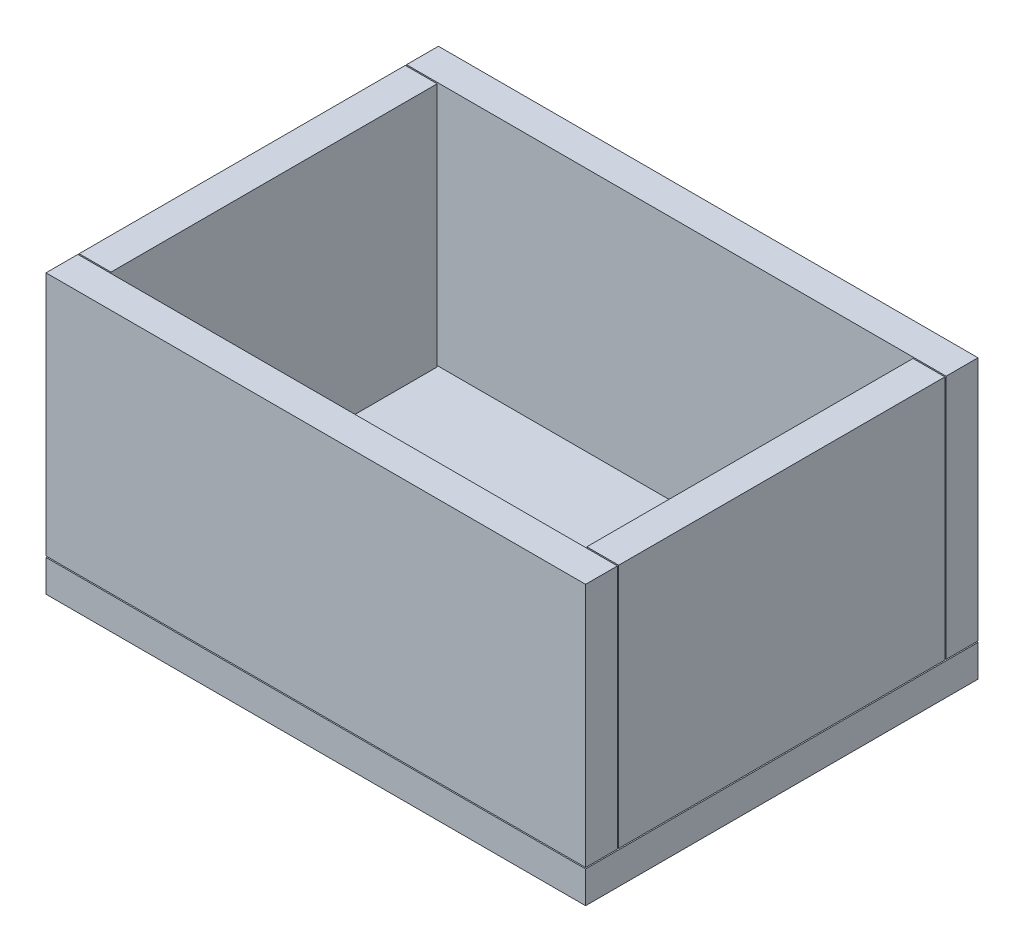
ISO-10303-21;
HEADER;
FILE_DESCRIPTION(('STEP AP214'),'2;1');
FILE_NAME('part.step','',(''),(''),'','','');
FILE_SCHEMA(('AUTOMOTIVE_DESIGN { 1 0 10303 214 1 1 1 1 }'));
ENDSEC;
DATA;
#1=APPLICATION_CONTEXT('core data for automotive mechanical design processes');
#2=APPLICATION_PROTOCOL_DEFINITION('international standard','automotive_design',2000,#1);
#3=PRODUCT_CONTEXT('',#1,'mechanical');
#4=PRODUCT('Part','Part','',(#3));
#5=PRODUCT_RELATED_PRODUCT_CATEGORY('part','',(#4));
#6=PRODUCT_DEFINITION_FORMATION('','',#4);
#7=PRODUCT_DEFINITION_CONTEXT('part definition',#1,'design');
#8=PRODUCT_DEFINITION('design','',#6,#7);
#9=PRODUCT_DEFINITION_SHAPE('','',#8);
#10=(LENGTH_UNIT() NAMED_UNIT(*) SI_UNIT(.MILLI.,.METRE.));
#11=(NAMED_UNIT(*) PLANE_ANGLE_UNIT() SI_UNIT($,.RADIAN.));
#12=(NAMED_UNIT(*) SI_UNIT($,.STERADIAN.) SOLID_ANGLE_UNIT());
#13=UNCERTAINTY_MEASURE_WITH_UNIT(LENGTH_MEASURE(1.E-05),#10,'distance_accuracy_value','');
#14=(GEOMETRIC_REPRESENTATION_CONTEXT(3) GLOBAL_UNCERTAINTY_ASSIGNED_CONTEXT((#13)) GLOBAL_UNIT_ASSIGNED_CONTEXT((#10,
#11,#12)) REPRESENTATION_CONTEXT('',''));
#15=CARTESIAN_POINT('',(0.,0.,0.));
#16=DIRECTION('',(0.,0.,1.));
#17=DIRECTION('',(1.,0.,0.));
#18=AXIS2_PLACEMENT_3D('',#15,#16,#17);
#19=CARTESIAN_POINT('',(110.,247.13382805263,-66.5));
#20=DIRECTION('',(-1.,0.,0.));
#21=DIRECTION('',(0.,0.,1.));
#22=AXIS2_PLACEMENT_3D('',#19,#20,#21);
#23=PLANE('',#22);
#24=DIRECTION('',(0.,0.,-1.));
#25=VECTOR('',#24,1.);
#26=CARTESIAN_POINT('',(110.,113.5,-66.5));
#27=LINE('',#26,#25);
#28=CARTESIAN_POINT('',(110.,113.5,66.5));
#29=VERTEX_POINT('',#28);
#30=CARTESIAN_POINT('',(110.,113.5,-66.5));
#31=VERTEX_POINT('',#30);
#32=EDGE_CURVE('E94',#29,#31,#27,.T.);
#33=ORIENTED_EDGE('',*,*,#32,.F.);
#34=DIRECTION('',(0.,-1.,0.));
#35=VECTOR('',#34,1.);
#36=CARTESIAN_POINT('',(110.,247.13382805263,66.5));
#37=LINE('',#36,#35);
#38=CARTESIAN_POINT('',(110.,13.5,66.5));
#39=VERTEX_POINT('',#38);
#40=EDGE_CURVE('E48',#29,#39,#37,.T.);
#41=ORIENTED_EDGE('',*,*,#40,.T.);
#42=DIRECTION('',(0.,0.,-1.));
#43=VECTOR('',#42,1.);
#44=CARTESIAN_POINT('',(110.,13.5,-66.5));
#45=LINE('',#44,#43);
#46=CARTESIAN_POINT('',(110.,13.5,-66.5));
#47=VERTEX_POINT('',#46);
#48=EDGE_CURVE('E92',#39,#47,#45,.T.);
#49=ORIENTED_EDGE('',*,*,#48,.T.);
#50=DIRECTION('',(0.,-1.,0.));
#51=VECTOR('',#50,1.);
#52=CARTESIAN_POINT('',(110.,247.13382805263,-66.5));
#53=LINE('',#52,#51);
#54=EDGE_CURVE('E83',#31,#47,#53,.T.);
#55=ORIENTED_EDGE('',*,*,#54,.F.);
#56=EDGE_LOOP('',(#33,#41,#49,#55));
#57=FACE_BOUND('',#56,.T.);
#58=ADVANCED_FACE('F44',(#57),#23,.F.);
#59=CARTESIAN_POINT('',(110.,247.13382805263,-66.5));
#60=DIRECTION('',(0.,0.,1.));
#61=DIRECTION('',(1.,0.,0.));
#62=AXIS2_PLACEMENT_3D('',#59,#60,#61);
#63=PLANE('',#62);
#64=DIRECTION('',(-1.,0.,0.));
#65=VECTOR('',#64,1.);
#66=CARTESIAN_POINT('',(110.,113.5,-66.5));
#67=LINE('',#66,#65);
#68=CARTESIAN_POINT('',(97.,113.5,-66.5));
#69=VERTEX_POINT('',#68);
#70=EDGE_CURVE('E53',#31,#69,#67,.T.);
#71=ORIENTED_EDGE('',*,*,#70,.F.);
#72=ORIENTED_EDGE('',*,*,#54,.T.);
#73=DIRECTION('',(-1.,0.,0.));
#74=VECTOR('',#73,1.);
#75=CARTESIAN_POINT('',(110.,13.5,-66.5));
#76=LINE('',#75,#74);
#77=CARTESIAN_POINT('',(97.,13.5,-66.5));
#78=VERTEX_POINT('',#77);
#79=EDGE_CURVE('E104',#47,#78,#76,.T.);
#80=ORIENTED_EDGE('',*,*,#79,.T.);
#81=DIRECTION('',(0.,-1.,0.));
#82=VECTOR('',#81,1.);
#83=CARTESIAN_POINT('',(97.,247.13382805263,-66.5));
#84=LINE('',#83,#82);
#85=EDGE_CURVE('E113',#69,#78,#84,.T.);
#86=ORIENTED_EDGE('',*,*,#85,.F.);
#87=EDGE_LOOP('',(#71,#72,#80,#86));
#88=FACE_BOUND('',#87,.T.);
#89=ADVANCED_FACE('F117',(#88),#63,.F.);
#90=CARTESIAN_POINT('',(97.,247.13382805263,-66.5));
#91=DIRECTION('',(1.,0.,0.));
#92=DIRECTION('',(0.,0.,-1.));
#93=AXIS2_PLACEMENT_3D('',#90,#91,#92);
#94=PLANE('',#93);
#95=DIRECTION('',(0.,0.,1.));
#96=VECTOR('',#95,1.);
#97=CARTESIAN_POINT('',(97.,113.5,-66.5));
#98=LINE('',#97,#96);
#99=CARTESIAN_POINT('',(97.,113.5,66.5));
#100=VERTEX_POINT('',#99);
#101=EDGE_CURVE('E12',#69,#100,#98,.T.);
#102=ORIENTED_EDGE('',*,*,#101,.F.);
#103=ORIENTED_EDGE('',*,*,#85,.T.);
#104=DIRECTION('',(0.,0.,1.));
#105=VECTOR('',#104,1.);
#106=CARTESIAN_POINT('',(97.,13.5,-66.5));
#107=LINE('',#106,#105);
#108=CARTESIAN_POINT('',(97.,13.5,66.5));
#109=VERTEX_POINT('',#108);
#110=EDGE_CURVE('E114',#78,#109,#107,.T.);
#111=ORIENTED_EDGE('',*,*,#110,.T.);
#112=DIRECTION('',(0.,-1.,0.));
#113=VECTOR('',#112,1.);
#114=CARTESIAN_POINT('',(97.,247.13382805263,66.5));
#115=LINE('',#114,#113);
#116=EDGE_CURVE('E66',#100,#109,#115,.T.);
#117=ORIENTED_EDGE('',*,*,#116,.F.);
#118=EDGE_LOOP('',(#102,#103,#111,#117));
#119=FACE_BOUND('',#118,.T.);
#120=ADVANCED_FACE('F116',(#119),#94,.F.);
#121=CARTESIAN_POINT('',(110.,247.13382805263,66.5));
#122=DIRECTION('',(0.,0.,-1.));
#123=DIRECTION('',(-1.,0.,0.));
#124=AXIS2_PLACEMENT_3D('',#121,#122,#123);
#125=PLANE('',#124);
#126=DIRECTION('',(1.,0.,0.));
#127=VECTOR('',#126,1.);
#128=CARTESIAN_POINT('',(110.,113.5,66.5));
#129=LINE('',#128,#127);
#130=EDGE_CURVE('E101',#100,#29,#129,.T.);
#131=ORIENTED_EDGE('',*,*,#130,.F.);
#132=ORIENTED_EDGE('',*,*,#116,.T.);
#133=DIRECTION('',(1.,0.,0.));
#134=VECTOR('',#133,1.);
#135=CARTESIAN_POINT('',(110.,13.5,66.5));
#136=LINE('',#135,#134);
#137=EDGE_CURVE('E97',#109,#39,#136,.T.);
#138=ORIENTED_EDGE('',*,*,#137,.T.);
#139=ORIENTED_EDGE('',*,*,#40,.F.);
#140=EDGE_LOOP('',(#131,#132,#138,#139));
#141=FACE_BOUND('',#140,.T.);
#142=ADVANCED_FACE('F98',(#141),#125,.F.);
#143=CARTESIAN_POINT('',(0.,13.5,0.));
#144=DIRECTION('',(0.,-1.,0.));
#145=DIRECTION('',(0.,0.,-1.));
#146=AXIS2_PLACEMENT_3D('',#143,#144,#145);
#147=PLANE('',#146);
#148=ORIENTED_EDGE('',*,*,#48,.F.);
#149=ORIENTED_EDGE('',*,*,#137,.F.);
#150=ORIENTED_EDGE('',*,*,#110,.F.);
#151=ORIENTED_EDGE('',*,*,#79,.F.);
#152=EDGE_LOOP('',(#148,#149,#150,#151));
#153=FACE_BOUND('',#152,.T.);
#154=ADVANCED_FACE('F103',(#153),#147,.T.);
#155=CARTESIAN_POINT('',(0.,113.5,0.));
#156=DIRECTION('',(0.,1.,0.));
#157=DIRECTION('',(0.,0.,1.));
#158=AXIS2_PLACEMENT_3D('',#155,#156,#157);
#159=PLANE('',#158);
#160=ORIENTED_EDGE('',*,*,#130,.T.);
#161=ORIENTED_EDGE('',*,*,#32,.T.);
#162=ORIENTED_EDGE('',*,*,#70,.T.);
#163=ORIENTED_EDGE('',*,*,#101,.T.);
#164=EDGE_LOOP('',(#160,#161,#162,#163));
#165=FACE_BOUND('',#164,.T.);
#166=ADVANCED_FACE('F46',(#165),#159,.T.);
#167=CLOSED_SHELL('',(#58,#89,#120,#142,#154,#166));
#168=MANIFOLD_SOLID_BREP('B2',#167);
#169=CARTESIAN_POINT('',(-110.,247.13382805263,-66.5));
#170=DIRECTION('',(1.,0.,0.));
#171=DIRECTION('',(0.,0.,-1.));
#172=AXIS2_PLACEMENT_3D('',#169,#170,#171);
#173=PLANE('',#172);
#174=DIRECTION('',(0.,0.,1.));
#175=VECTOR('',#174,1.);
#176=CARTESIAN_POINT('',(-110.,113.5,-66.5));
#177=LINE('',#176,#175);
#178=CARTESIAN_POINT('',(-110.,113.5,-66.5));
#179=VERTEX_POINT('',#178);
#180=CARTESIAN_POINT('',(-110.,113.5,66.5));
#181=VERTEX_POINT('',#180);
#182=EDGE_CURVE('E228',#179,#181,#177,.T.);
#183=ORIENTED_EDGE('',*,*,#182,.F.);
#184=DIRECTION('',(0.,-1.,0.));
#185=VECTOR('',#184,1.);
#186=CARTESIAN_POINT('',(-110.,247.13382805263,-66.5));
#187=LINE('',#186,#185);
#188=CARTESIAN_POINT('',(-110.,13.5,-66.5));
#189=VERTEX_POINT('',#188);
#190=EDGE_CURVE('E182',#179,#189,#187,.T.);
#191=ORIENTED_EDGE('',*,*,#190,.T.);
#192=DIRECTION('',(0.,0.,1.));
#193=VECTOR('',#192,1.);
#194=CARTESIAN_POINT('',(-110.,13.5,-66.5));
#195=LINE('',#194,#193);
#196=CARTESIAN_POINT('',(-110.,13.5,66.5));
#197=VERTEX_POINT('',#196);
#198=EDGE_CURVE('E226',#189,#197,#195,.T.);
#199=ORIENTED_EDGE('',*,*,#198,.T.);
#200=DIRECTION('',(0.,-1.,0.));
#201=VECTOR('',#200,1.);
#202=CARTESIAN_POINT('',(-110.,247.13382805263,66.5));
#203=LINE('',#202,#201);
#204=EDGE_CURVE('E217',#181,#197,#203,.T.);
#205=ORIENTED_EDGE('',*,*,#204,.F.);
#206=EDGE_LOOP('',(#183,#191,#199,#205));
#207=FACE_BOUND('',#206,.T.);
#208=ADVANCED_FACE('F178',(#207),#173,.F.);
#209=CARTESIAN_POINT('',(-110.,247.13382805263,66.5));
#210=DIRECTION('',(0.,0.,-1.));
#211=DIRECTION('',(-1.,0.,0.));
#212=AXIS2_PLACEMENT_3D('',#209,#210,#211);
#213=PLANE('',#212);
#214=DIRECTION('',(1.,0.,0.));
#215=VECTOR('',#214,1.);
#216=CARTESIAN_POINT('',(-110.,113.5,66.5));
#217=LINE('',#216,#215);
#218=CARTESIAN_POINT('',(-97.,113.5,66.5));
#219=VERTEX_POINT('',#218);
#220=EDGE_CURVE('E187',#181,#219,#217,.T.);
#221=ORIENTED_EDGE('',*,*,#220,.F.);
#222=ORIENTED_EDGE('',*,*,#204,.T.);
#223=DIRECTION('',(1.,0.,0.));
#224=VECTOR('',#223,1.);
#225=CARTESIAN_POINT('',(-110.,13.5,66.5));
#226=LINE('',#225,#224);
#227=CARTESIAN_POINT('',(-97.,13.5,66.5));
#228=VERTEX_POINT('',#227);
#229=EDGE_CURVE('E238',#197,#228,#226,.T.);
#230=ORIENTED_EDGE('',*,*,#229,.T.);
#231=DIRECTION('',(0.,-1.,0.));
#232=VECTOR('',#231,1.);
#233=CARTESIAN_POINT('',(-97.,247.13382805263,66.5));
#234=LINE('',#233,#232);
#235=EDGE_CURVE('E247',#219,#228,#234,.T.);
#236=ORIENTED_EDGE('',*,*,#235,.F.);
#237=EDGE_LOOP('',(#221,#222,#230,#236));
#238=FACE_BOUND('',#237,.T.);
#239=ADVANCED_FACE('F251',(#238),#213,.F.);
#240=CARTESIAN_POINT('',(-97.,247.13382805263,-66.5));
#241=DIRECTION('',(-1.,0.,0.));
#242=DIRECTION('',(0.,0.,1.));
#243=AXIS2_PLACEMENT_3D('',#240,#241,#242);
#244=PLANE('',#243);
#245=DIRECTION('',(0.,0.,-1.));
#246=VECTOR('',#245,1.);
#247=CARTESIAN_POINT('',(-97.,113.5,-66.5));
#248=LINE('',#247,#246);
#249=CARTESIAN_POINT('',(-97.,113.5,-66.5));
#250=VERTEX_POINT('',#249);
#251=EDGE_CURVE('E42',#219,#250,#248,.T.);
#252=ORIENTED_EDGE('',*,*,#251,.F.);
#253=ORIENTED_EDGE('',*,*,#235,.T.);
#254=DIRECTION('',(0.,0.,-1.));
#255=VECTOR('',#254,1.);
#256=CARTESIAN_POINT('',(-97.,13.5,-66.5));
#257=LINE('',#256,#255);
#258=CARTESIAN_POINT('',(-97.,13.5,-66.5));
#259=VERTEX_POINT('',#258);
#260=EDGE_CURVE('E248',#228,#259,#257,.T.);
#261=ORIENTED_EDGE('',*,*,#260,.T.);
#262=DIRECTION('',(0.,-1.,0.));
#263=VECTOR('',#262,1.);
#264=CARTESIAN_POINT('',(-97.,247.13382805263,-66.5));
#265=LINE('',#264,#263);
#266=EDGE_CURVE('E200',#250,#259,#265,.T.);
#267=ORIENTED_EDGE('',*,*,#266,.F.);
#268=EDGE_LOOP('',(#252,#253,#261,#267));
#269=FACE_BOUND('',#268,.T.);
#270=ADVANCED_FACE('F250',(#269),#244,.F.);
#271=CARTESIAN_POINT('',(-110.,247.13382805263,-66.5));
#272=DIRECTION('',(0.,0.,1.));
#273=DIRECTION('',(1.,0.,0.));
#274=AXIS2_PLACEMENT_3D('',#271,#272,#273);
#275=PLANE('',#274);
#276=DIRECTION('',(-1.,0.,0.));
#277=VECTOR('',#276,1.);
#278=CARTESIAN_POINT('',(-110.,113.5,-66.5));
#279=LINE('',#278,#277);
#280=EDGE_CURVE('E235',#250,#179,#279,.T.);
#281=ORIENTED_EDGE('',*,*,#280,.F.);
#282=ORIENTED_EDGE('',*,*,#266,.T.);
#283=DIRECTION('',(-1.,0.,0.));
#284=VECTOR('',#283,1.);
#285=CARTESIAN_POINT('',(-110.,13.5,-66.5));
#286=LINE('',#285,#284);
#287=EDGE_CURVE('E231',#259,#189,#286,.T.);
#288=ORIENTED_EDGE('',*,*,#287,.T.);
#289=ORIENTED_EDGE('',*,*,#190,.F.);
#290=EDGE_LOOP('',(#281,#282,#288,#289));
#291=FACE_BOUND('',#290,.T.);
#292=ADVANCED_FACE('F232',(#291),#275,.F.);
#293=CARTESIAN_POINT('',(0.,13.5,0.));
#294=DIRECTION('',(0.,1.,0.));
#295=DIRECTION('',(0.,0.,1.));
#296=AXIS2_PLACEMENT_3D('',#293,#294,#295);
#297=PLANE('',#296);
#298=ORIENTED_EDGE('',*,*,#198,.F.);
#299=ORIENTED_EDGE('',*,*,#287,.F.);
#300=ORIENTED_EDGE('',*,*,#260,.F.);
#301=ORIENTED_EDGE('',*,*,#229,.F.);
#302=EDGE_LOOP('',(#298,#299,#300,#301));
#303=FACE_BOUND('',#302,.T.);
#304=ADVANCED_FACE('F237',(#303),#297,.F.);
#305=CARTESIAN_POINT('',(0.,113.5,0.));
#306=DIRECTION('',(0.,1.,0.));
#307=DIRECTION('',(0.,0.,1.));
#308=AXIS2_PLACEMENT_3D('',#305,#306,#307);
#309=PLANE('',#308);
#310=ORIENTED_EDGE('',*,*,#280,.T.);
#311=ORIENTED_EDGE('',*,*,#182,.T.);
#312=ORIENTED_EDGE('',*,*,#220,.T.);
#313=ORIENTED_EDGE('',*,*,#251,.T.);
#314=EDGE_LOOP('',(#310,#311,#312,#313));
#315=FACE_BOUND('',#314,.T.);
#316=ADVANCED_FACE('F180',(#315),#309,.T.);
#317=CLOSED_SHELL('',(#208,#239,#270,#292,#304,#316));
#318=MANIFOLD_SOLID_BREP('B6',#317);
#319=CARTESIAN_POINT('',(-110.,113.5,80.));
#320=DIRECTION('',(1.,0.,0.));
#321=DIRECTION('',(0.,0.,-1.));
#322=AXIS2_PLACEMENT_3D('',#319,#320,#321);
#323=PLANE('',#322);
#324=DIRECTION('',(0.,0.,1.));
#325=VECTOR('',#324,1.);
#326=CARTESIAN_POINT('',(-110.,13.5,80.));
#327=LINE('',#326,#325);
#328=CARTESIAN_POINT('',(-110.,13.5,67.));
#329=VERTEX_POINT('',#328);
#330=CARTESIAN_POINT('',(-110.,13.5,80.));
#331=VERTEX_POINT('',#330);
#332=EDGE_CURVE('E375',#329,#331,#327,.T.);
#333=ORIENTED_EDGE('',*,*,#332,.T.);
#334=DIRECTION('',(0.,-1.,0.));
#335=VECTOR('',#334,1.);
#336=CARTESIAN_POINT('',(-110.,113.5,80.));
#337=LINE('',#336,#335);
#338=CARTESIAN_POINT('',(-110.,113.5,80.));
#339=VERTEX_POINT('',#338);
#340=EDGE_CURVE('E176',#339,#331,#337,.T.);
#341=ORIENTED_EDGE('',*,*,#340,.F.);
#342=DIRECTION('',(0.,0.,1.));
#343=VECTOR('',#342,1.);
#344=CARTESIAN_POINT('',(-110.,113.5,80.));
#345=LINE('',#344,#343);
#346=CARTESIAN_POINT('',(-110.,113.5,67.));
#347=VERTEX_POINT('',#346);
#348=EDGE_CURVE('E363',#347,#339,#345,.T.);
#349=ORIENTED_EDGE('',*,*,#348,.F.);
#350=DIRECTION('',(0.,-1.,0.));
#351=VECTOR('',#350,1.);
#352=CARTESIAN_POINT('',(-110.,113.5,67.));
#353=LINE('',#352,#351);
#354=EDGE_CURVE('E371',#347,#329,#353,.T.);
#355=ORIENTED_EDGE('',*,*,#354,.T.);
#356=EDGE_LOOP('',(#333,#341,#349,#355));
#357=FACE_BOUND('',#356,.T.);
#358=ADVANCED_FACE('F312',(#357),#323,.F.);
#359=CARTESIAN_POINT('',(-110.,113.5,80.));
#360=DIRECTION('',(0.,0.,-1.));
#361=DIRECTION('',(-1.,0.,0.));
#362=AXIS2_PLACEMENT_3D('',#359,#360,#361);
#363=PLANE('',#362);
#364=DIRECTION('',(1.,0.,0.));
#365=VECTOR('',#364,1.);
#366=CARTESIAN_POINT('',(-110.,13.5,80.));
#367=LINE('',#366,#365);
#368=CARTESIAN_POINT('',(110.,13.5,80.));
#369=VERTEX_POINT('',#368);
#370=EDGE_CURVE('E367',#331,#369,#367,.T.);
#371=ORIENTED_EDGE('',*,*,#370,.T.);
#372=DIRECTION('',(0.,-1.,0.));
#373=VECTOR('',#372,1.);
#374=CARTESIAN_POINT('',(110.,113.5,80.));
#375=LINE('',#374,#373);
#376=CARTESIAN_POINT('',(110.,113.5,80.));
#377=VERTEX_POINT('',#376);
#378=EDGE_CURVE('E320',#377,#369,#375,.T.);
#379=ORIENTED_EDGE('',*,*,#378,.F.);
#380=DIRECTION('',(1.,0.,0.));
#381=VECTOR('',#380,1.);
#382=CARTESIAN_POINT('',(-110.,113.5,80.));
#383=LINE('',#382,#381);
#384=EDGE_CURVE('E358',#339,#377,#383,.T.);
#385=ORIENTED_EDGE('',*,*,#384,.F.);
#386=ORIENTED_EDGE('',*,*,#340,.T.);
#387=EDGE_LOOP('',(#371,#379,#385,#386));
#388=FACE_BOUND('',#387,.T.);
#389=ADVANCED_FACE('F366',(#388),#363,.F.);
#390=CARTESIAN_POINT('',(110.,113.5,80.));
#391=DIRECTION('',(-1.,0.,0.));
#392=DIRECTION('',(0.,0.,1.));
#393=AXIS2_PLACEMENT_3D('',#390,#391,#392);
#394=PLANE('',#393);
#395=DIRECTION('',(0.,0.,-1.));
#396=VECTOR('',#395,1.);
#397=CARTESIAN_POINT('',(110.,13.5,80.));
#398=LINE('',#397,#396);
#399=CARTESIAN_POINT('',(110.,13.5,67.));
#400=VERTEX_POINT('',#399);
#401=EDGE_CURVE('E345',#369,#400,#398,.T.);
#402=ORIENTED_EDGE('',*,*,#401,.T.);
#403=DIRECTION('',(0.,-1.,0.));
#404=VECTOR('',#403,1.);
#405=CARTESIAN_POINT('',(110.,113.5,67.));
#406=LINE('',#405,#404);
#407=CARTESIAN_POINT('',(110.,113.5,67.));
#408=VERTEX_POINT('',#407);
#409=EDGE_CURVE('E368',#408,#400,#406,.T.);
#410=ORIENTED_EDGE('',*,*,#409,.F.);
#411=DIRECTION('',(0.,0.,-1.));
#412=VECTOR('',#411,1.);
#413=CARTESIAN_POINT('',(110.,113.5,80.));
#414=LINE('',#413,#412);
#415=EDGE_CURVE('E361',#377,#408,#414,.T.);
#416=ORIENTED_EDGE('',*,*,#415,.F.);
#417=ORIENTED_EDGE('',*,*,#378,.T.);
#418=EDGE_LOOP('',(#402,#410,#416,#417));
#419=FACE_BOUND('',#418,.T.);
#420=ADVANCED_FACE('F369',(#419),#394,.F.);
#421=CARTESIAN_POINT('',(-110.,113.5,67.));
#422=DIRECTION('',(0.,0.,1.));
#423=DIRECTION('',(1.,0.,0.));
#424=AXIS2_PLACEMENT_3D('',#421,#422,#423);
#425=PLANE('',#424);
#426=DIRECTION('',(-1.,0.,0.));
#427=VECTOR('',#426,1.);
#428=CARTESIAN_POINT('',(-110.,13.5,67.));
#429=LINE('',#428,#427);
#430=EDGE_CURVE('E351',#400,#329,#429,.T.);
#431=ORIENTED_EDGE('',*,*,#430,.T.);
#432=ORIENTED_EDGE('',*,*,#354,.F.);
#433=DIRECTION('',(-1.,0.,0.));
#434=VECTOR('',#433,1.);
#435=CARTESIAN_POINT('',(-110.,113.5,67.));
#436=LINE('',#435,#434);
#437=EDGE_CURVE('E328',#408,#347,#436,.T.);
#438=ORIENTED_EDGE('',*,*,#437,.F.);
#439=ORIENTED_EDGE('',*,*,#409,.T.);
#440=EDGE_LOOP('',(#431,#432,#438,#439));
#441=FACE_BOUND('',#440,.T.);
#442=ADVANCED_FACE('F382',(#441),#425,.F.);
#443=CARTESIAN_POINT('',(0.,113.5,0.));
#444=DIRECTION('',(0.,-1.,0.));
#445=DIRECTION('',(0.,0.,-1.));
#446=AXIS2_PLACEMENT_3D('',#443,#444,#445);
#447=PLANE('',#446);
#448=ORIENTED_EDGE('',*,*,#348,.T.);
#449=ORIENTED_EDGE('',*,*,#384,.T.);
#450=ORIENTED_EDGE('',*,*,#415,.T.);
#451=ORIENTED_EDGE('',*,*,#437,.T.);
#452=EDGE_LOOP('',(#448,#449,#450,#451));
#453=FACE_BOUND('',#452,.T.);
#454=ADVANCED_FACE('F359',(#453),#447,.F.);
#455=CARTESIAN_POINT('',(0.,13.5,0.));
#456=DIRECTION('',(0.,-1.,0.));
#457=DIRECTION('',(0.,0.,-1.));
#458=AXIS2_PLACEMENT_3D('',#455,#456,#457);
#459=PLANE('',#458);
#460=ORIENTED_EDGE('',*,*,#332,.F.);
#461=ORIENTED_EDGE('',*,*,#430,.F.);
#462=ORIENTED_EDGE('',*,*,#401,.F.);
#463=ORIENTED_EDGE('',*,*,#370,.F.);
#464=EDGE_LOOP('',(#460,#461,#462,#463));
#465=FACE_BOUND('',#464,.T.);
#466=ADVANCED_FACE('F385',(#465),#459,.T.);
#467=CLOSED_SHELL('',(#358,#389,#420,#442,#454,#466));
#468=MANIFOLD_SOLID_BREP('B36',#467);
#469=CARTESIAN_POINT('',(-110.,113.5,-80.));
#470=DIRECTION('',(1.,0.,0.));
#471=DIRECTION('',(0.,0.,-1.));
#472=AXIS2_PLACEMENT_3D('',#469,#470,#471);
#473=PLANE('',#472);
#474=DIRECTION('',(0.,0.,1.));
#475=VECTOR('',#474,1.);
#476=CARTESIAN_POINT('',(-110.,13.5,-80.));
#477=LINE('',#476,#475);
#478=CARTESIAN_POINT('',(-110.,13.5,-80.));
#479=VERTEX_POINT('',#478);
#480=CARTESIAN_POINT('',(-110.,13.5,-67.));
#481=VERTEX_POINT('',#480);
#482=EDGE_CURVE('E508',#479,#481,#477,.T.);
#483=ORIENTED_EDGE('',*,*,#482,.T.);
#484=DIRECTION('',(0.,-1.,0.));
#485=VECTOR('',#484,1.);
#486=CARTESIAN_POINT('',(-110.,113.5,-67.));
#487=LINE('',#486,#485);
#488=CARTESIAN_POINT('',(-110.,113.5,-67.));
#489=VERTEX_POINT('',#488);
#490=EDGE_CURVE('E310',#489,#481,#487,.T.);
#491=ORIENTED_EDGE('',*,*,#490,.F.);
#492=DIRECTION('',(0.,0.,1.));
#493=VECTOR('',#492,1.);
#494=CARTESIAN_POINT('',(-110.,113.5,-80.));
#495=LINE('',#494,#493);
#496=CARTESIAN_POINT('',(-110.,113.5,-80.));
#497=VERTEX_POINT('',#496);
#498=EDGE_CURVE('E496',#497,#489,#495,.T.);
#499=ORIENTED_EDGE('',*,*,#498,.F.);
#500=DIRECTION('',(0.,-1.,0.));
#501=VECTOR('',#500,1.);
#502=CARTESIAN_POINT('',(-110.,113.5,-80.));
#503=LINE('',#502,#501);
#504=EDGE_CURVE('E504',#497,#479,#503,.T.);
#505=ORIENTED_EDGE('',*,*,#504,.T.);
#506=EDGE_LOOP('',(#483,#491,#499,#505));
#507=FACE_BOUND('',#506,.T.);
#508=ADVANCED_FACE('F445',(#507),#473,.F.);
#509=CARTESIAN_POINT('',(-110.,113.5,-67.));
#510=DIRECTION('',(0.,0.,-1.));
#511=DIRECTION('',(-1.,0.,0.));
#512=AXIS2_PLACEMENT_3D('',#509,#510,#511);
#513=PLANE('',#512);
#514=DIRECTION('',(1.,0.,0.));
#515=VECTOR('',#514,1.);
#516=CARTESIAN_POINT('',(-110.,13.5,-67.));
#517=LINE('',#516,#515);
#518=CARTESIAN_POINT('',(110.,13.5,-67.));
#519=VERTEX_POINT('',#518);
#520=EDGE_CURVE('E500',#481,#519,#517,.T.);
#521=ORIENTED_EDGE('',*,*,#520,.T.);
#522=DIRECTION('',(0.,-1.,0.));
#523=VECTOR('',#522,1.);
#524=CARTESIAN_POINT('',(110.,113.5,-67.));
#525=LINE('',#524,#523);
#526=CARTESIAN_POINT('',(110.,113.5,-67.));
#527=VERTEX_POINT('',#526);
#528=EDGE_CURVE('E453',#527,#519,#525,.T.);
#529=ORIENTED_EDGE('',*,*,#528,.F.);
#530=DIRECTION('',(1.,0.,0.));
#531=VECTOR('',#530,1.);
#532=CARTESIAN_POINT('',(-110.,113.5,-67.));
#533=LINE('',#532,#531);
#534=EDGE_CURVE('E491',#489,#527,#533,.T.);
#535=ORIENTED_EDGE('',*,*,#534,.F.);
#536=ORIENTED_EDGE('',*,*,#490,.T.);
#537=EDGE_LOOP('',(#521,#529,#535,#536));
#538=FACE_BOUND('',#537,.T.);
#539=ADVANCED_FACE('F499',(#538),#513,.F.);
#540=CARTESIAN_POINT('',(110.,113.5,-80.));
#541=DIRECTION('',(-1.,0.,0.));
#542=DIRECTION('',(0.,0.,1.));
#543=AXIS2_PLACEMENT_3D('',#540,#541,#542);
#544=PLANE('',#543);
#545=DIRECTION('',(0.,0.,-1.));
#546=VECTOR('',#545,1.);
#547=CARTESIAN_POINT('',(110.,13.5,-80.));
#548=LINE('',#547,#546);
#549=CARTESIAN_POINT('',(110.,13.5,-80.));
#550=VERTEX_POINT('',#549);
#551=EDGE_CURVE('E478',#519,#550,#548,.T.);
#552=ORIENTED_EDGE('',*,*,#551,.T.);
#553=DIRECTION('',(0.,-1.,0.));
#554=VECTOR('',#553,1.);
#555=CARTESIAN_POINT('',(110.,113.5,-80.));
#556=LINE('',#555,#554);
#557=CARTESIAN_POINT('',(110.,113.5,-80.));
#558=VERTEX_POINT('',#557);
#559=EDGE_CURVE('E501',#558,#550,#556,.T.);
#560=ORIENTED_EDGE('',*,*,#559,.F.);
#561=DIRECTION('',(0.,0.,-1.));
#562=VECTOR('',#561,1.);
#563=CARTESIAN_POINT('',(110.,113.5,-80.));
#564=LINE('',#563,#562);
#565=EDGE_CURVE('E494',#527,#558,#564,.T.);
#566=ORIENTED_EDGE('',*,*,#565,.F.);
#567=ORIENTED_EDGE('',*,*,#528,.T.);
#568=EDGE_LOOP('',(#552,#560,#566,#567));
#569=FACE_BOUND('',#568,.T.);
#570=ADVANCED_FACE('F502',(#569),#544,.F.);
#571=CARTESIAN_POINT('',(-110.,113.5,-80.));
#572=DIRECTION('',(0.,0.,1.));
#573=DIRECTION('',(1.,0.,0.));
#574=AXIS2_PLACEMENT_3D('',#571,#572,#573);
#575=PLANE('',#574);
#576=DIRECTION('',(-1.,0.,0.));
#577=VECTOR('',#576,1.);
#578=CARTESIAN_POINT('',(-110.,13.5,-80.));
#579=LINE('',#578,#577);
#580=EDGE_CURVE('E484',#550,#479,#579,.T.);
#581=ORIENTED_EDGE('',*,*,#580,.T.);
#582=ORIENTED_EDGE('',*,*,#504,.F.);
#583=DIRECTION('',(-1.,0.,0.));
#584=VECTOR('',#583,1.);
#585=CARTESIAN_POINT('',(-110.,113.5,-80.));
#586=LINE('',#585,#584);
#587=EDGE_CURVE('E461',#558,#497,#586,.T.);
#588=ORIENTED_EDGE('',*,*,#587,.F.);
#589=ORIENTED_EDGE('',*,*,#559,.T.);
#590=EDGE_LOOP('',(#581,#582,#588,#589));
#591=FACE_BOUND('',#590,.T.);
#592=ADVANCED_FACE('F515',(#591),#575,.F.);
#593=CARTESIAN_POINT('',(0.,113.5,0.));
#594=DIRECTION('',(0.,1.,0.));
#595=DIRECTION('',(0.,0.,1.));
#596=AXIS2_PLACEMENT_3D('',#593,#594,#595);
#597=PLANE('',#596);
#598=ORIENTED_EDGE('',*,*,#498,.T.);
#599=ORIENTED_EDGE('',*,*,#534,.T.);
#600=ORIENTED_EDGE('',*,*,#565,.T.);
#601=ORIENTED_EDGE('',*,*,#587,.T.);
#602=EDGE_LOOP('',(#598,#599,#600,#601));
#603=FACE_BOUND('',#602,.T.);
#604=ADVANCED_FACE('F492',(#603),#597,.T.);
#605=CARTESIAN_POINT('',(0.,13.5,0.));
#606=DIRECTION('',(0.,1.,0.));
#607=DIRECTION('',(0.,0.,1.));
#608=AXIS2_PLACEMENT_3D('',#605,#606,#607);
#609=PLANE('',#608);
#610=ORIENTED_EDGE('',*,*,#482,.F.);
#611=ORIENTED_EDGE('',*,*,#580,.F.);
#612=ORIENTED_EDGE('',*,*,#551,.F.);
#613=ORIENTED_EDGE('',*,*,#520,.F.);
#614=EDGE_LOOP('',(#610,#611,#612,#613));
#615=FACE_BOUND('',#614,.T.);
#616=ADVANCED_FACE('F518',(#615),#609,.F.);
#617=CLOSED_SHELL('',(#508,#539,#570,#592,#604,#616));
#618=MANIFOLD_SOLID_BREP('B170',#617);
#619=CARTESIAN_POINT('',(-110.,13.,-80.));
#620=DIRECTION('',(1.,0.,0.));
#621=DIRECTION('',(0.,0.,-1.));
#622=AXIS2_PLACEMENT_3D('',#619,#620,#621);
#623=PLANE('',#622);
#624=DIRECTION('',(0.,0.,1.));
#625=VECTOR('',#624,1.);
#626=CARTESIAN_POINT('',(-110.,0.,-80.));
#627=LINE('',#626,#625);
#628=CARTESIAN_POINT('',(-110.,0.,-80.));
#629=VERTEX_POINT('',#628);
#630=CARTESIAN_POINT('',(-110.,0.,80.));
#631=VERTEX_POINT('',#630);
#632=EDGE_CURVE('E632',#629,#631,#627,.T.);
#633=ORIENTED_EDGE('',*,*,#632,.T.);
#634=DIRECTION('',(0.,-1.,0.));
#635=VECTOR('',#634,1.);
#636=CARTESIAN_POINT('',(-110.,13.,80.));
#637=LINE('',#636,#635);
#638=CARTESIAN_POINT('',(-110.,13.,80.));
#639=VERTEX_POINT('',#638);
#640=EDGE_CURVE('E443',#639,#631,#637,.T.);
#641=ORIENTED_EDGE('',*,*,#640,.F.);
#642=DIRECTION('',(0.,0.,1.));
#643=VECTOR('',#642,1.);
#644=CARTESIAN_POINT('',(-110.,13.,-80.));
#645=LINE('',#644,#643);
#646=CARTESIAN_POINT('',(-110.,13.,-80.));
#647=VERTEX_POINT('',#646);
#648=EDGE_CURVE('E620',#647,#639,#645,.T.);
#649=ORIENTED_EDGE('',*,*,#648,.F.);
#650=DIRECTION('',(0.,-1.,0.));
#651=VECTOR('',#650,1.);
#652=CARTESIAN_POINT('',(-110.,13.,-80.));
#653=LINE('',#652,#651);
#654=EDGE_CURVE('E628',#647,#629,#653,.T.);
#655=ORIENTED_EDGE('',*,*,#654,.T.);
#656=EDGE_LOOP('',(#633,#641,#649,#655));
#657=FACE_BOUND('',#656,.T.);
#658=ADVANCED_FACE('F569',(#657),#623,.F.);
#659=CARTESIAN_POINT('',(-110.,13.,80.));
#660=DIRECTION('',(0.,0.,-1.));
#661=DIRECTION('',(-1.,0.,0.));
#662=AXIS2_PLACEMENT_3D('',#659,#660,#661);
#663=PLANE('',#662);
#664=DIRECTION('',(1.,0.,0.));
#665=VECTOR('',#664,1.);
#666=CARTESIAN_POINT('',(-110.,0.,80.));
#667=LINE('',#666,#665);
#668=CARTESIAN_POINT('',(110.,0.,80.));
#669=VERTEX_POINT('',#668);
#670=EDGE_CURVE('E624',#631,#669,#667,.T.);
#671=ORIENTED_EDGE('',*,*,#670,.T.);
#672=DIRECTION('',(0.,-1.,0.));
#673=VECTOR('',#672,1.);
#674=CARTESIAN_POINT('',(110.,13.,80.));
#675=LINE('',#674,#673);
#676=CARTESIAN_POINT('',(110.,13.,80.));
#677=VERTEX_POINT('',#676);
#678=EDGE_CURVE('E577',#677,#669,#675,.T.);
#679=ORIENTED_EDGE('',*,*,#678,.F.);
#680=DIRECTION('',(1.,0.,0.));
#681=VECTOR('',#680,1.);
#682=CARTESIAN_POINT('',(-110.,13.,80.));
#683=LINE('',#682,#681);
#684=EDGE_CURVE('E615',#639,#677,#683,.T.);
#685=ORIENTED_EDGE('',*,*,#684,.F.);
#686=ORIENTED_EDGE('',*,*,#640,.T.);
#687=EDGE_LOOP('',(#671,#679,#685,#686));
#688=FACE_BOUND('',#687,.T.);
#689=ADVANCED_FACE('F623',(#688),#663,.F.);
#690=CARTESIAN_POINT('',(110.,13.,-80.));
#691=DIRECTION('',(-1.,0.,0.));
#692=DIRECTION('',(0.,0.,1.));
#693=AXIS2_PLACEMENT_3D('',#690,#691,#692);
#694=PLANE('',#693);
#695=DIRECTION('',(0.,0.,-1.));
#696=VECTOR('',#695,1.);
#697=CARTESIAN_POINT('',(110.,0.,-80.));
#698=LINE('',#697,#696);
#699=CARTESIAN_POINT('',(110.,0.,-80.));
#700=VERTEX_POINT('',#699);
#701=EDGE_CURVE('E602',#669,#700,#698,.T.);
#702=ORIENTED_EDGE('',*,*,#701,.T.);
#703=DIRECTION('',(0.,-1.,0.));
#704=VECTOR('',#703,1.);
#705=CARTESIAN_POINT('',(110.,13.,-80.));
#706=LINE('',#705,#704);
#707=CARTESIAN_POINT('',(110.,13.,-80.));
#708=VERTEX_POINT('',#707);
#709=EDGE_CURVE('E625',#708,#700,#706,.T.);
#710=ORIENTED_EDGE('',*,*,#709,.F.);
#711=DIRECTION('',(0.,0.,-1.));
#712=VECTOR('',#711,1.);
#713=CARTESIAN_POINT('',(110.,13.,-80.));
#714=LINE('',#713,#712);
#715=EDGE_CURVE('E618',#677,#708,#714,.T.);
#716=ORIENTED_EDGE('',*,*,#715,.F.);
#717=ORIENTED_EDGE('',*,*,#678,.T.);
#718=EDGE_LOOP('',(#702,#710,#716,#717));
#719=FACE_BOUND('',#718,.T.);
#720=ADVANCED_FACE('F626',(#719),#694,.F.);
#721=CARTESIAN_POINT('',(-110.,13.,-80.));
#722=DIRECTION('',(0.,0.,1.));
#723=DIRECTION('',(1.,0.,0.));
#724=AXIS2_PLACEMENT_3D('',#721,#722,#723);
#725=PLANE('',#724);
#726=DIRECTION('',(-1.,0.,0.));
#727=VECTOR('',#726,1.);
#728=CARTESIAN_POINT('',(-110.,0.,-80.));
#729=LINE('',#728,#727);
#730=EDGE_CURVE('E608',#700,#629,#729,.T.);
#731=ORIENTED_EDGE('',*,*,#730,.T.);
#732=ORIENTED_EDGE('',*,*,#654,.F.);
#733=DIRECTION('',(-1.,0.,0.));
#734=VECTOR('',#733,1.);
#735=CARTESIAN_POINT('',(-110.,13.,-80.));
#736=LINE('',#735,#734);
#737=EDGE_CURVE('E585',#708,#647,#736,.T.);
#738=ORIENTED_EDGE('',*,*,#737,.F.);
#739=ORIENTED_EDGE('',*,*,#709,.T.);
#740=EDGE_LOOP('',(#731,#732,#738,#739));
#741=FACE_BOUND('',#740,.T.);
#742=ADVANCED_FACE('F639',(#741),#725,.F.);
#743=CARTESIAN_POINT('',(0.,13.,0.));
#744=DIRECTION('',(0.,1.,0.));
#745=DIRECTION('',(0.,0.,1.));
#746=AXIS2_PLACEMENT_3D('',#743,#744,#745);
#747=PLANE('',#746);
#748=ORIENTED_EDGE('',*,*,#648,.T.);
#749=ORIENTED_EDGE('',*,*,#684,.T.);
#750=ORIENTED_EDGE('',*,*,#715,.T.);
#751=ORIENTED_EDGE('',*,*,#737,.T.);
#752=EDGE_LOOP('',(#748,#749,#750,#751));
#753=FACE_BOUND('',#752,.T.);
#754=ADVANCED_FACE('F616',(#753),#747,.T.);
#755=CARTESIAN_POINT('',(0.,0.,0.));
#756=DIRECTION('',(0.,1.,0.));
#757=DIRECTION('',(0.,0.,1.));
#758=AXIS2_PLACEMENT_3D('',#755,#756,#757);
#759=PLANE('',#758);
#760=ORIENTED_EDGE('',*,*,#632,.F.);
#761=ORIENTED_EDGE('',*,*,#730,.F.);
#762=ORIENTED_EDGE('',*,*,#701,.F.);
#763=ORIENTED_EDGE('',*,*,#670,.F.);
#764=EDGE_LOOP('',(#760,#761,#762,#763));
#765=FACE_BOUND('',#764,.T.);
#766=ADVANCED_FACE('F642',(#765),#759,.F.);
#767=CLOSED_SHELL('',(#658,#689,#720,#742,#754,#766));
#768=MANIFOLD_SOLID_BREP('B304',#767);
#769=ADVANCED_BREP_SHAPE_REPRESENTATION('',(#18,#168,#318,#468,#618,#768),#14);
#770=SHAPE_DEFINITION_REPRESENTATION(#9,#769);
ENDSEC;
END-ISO-10303-21;
